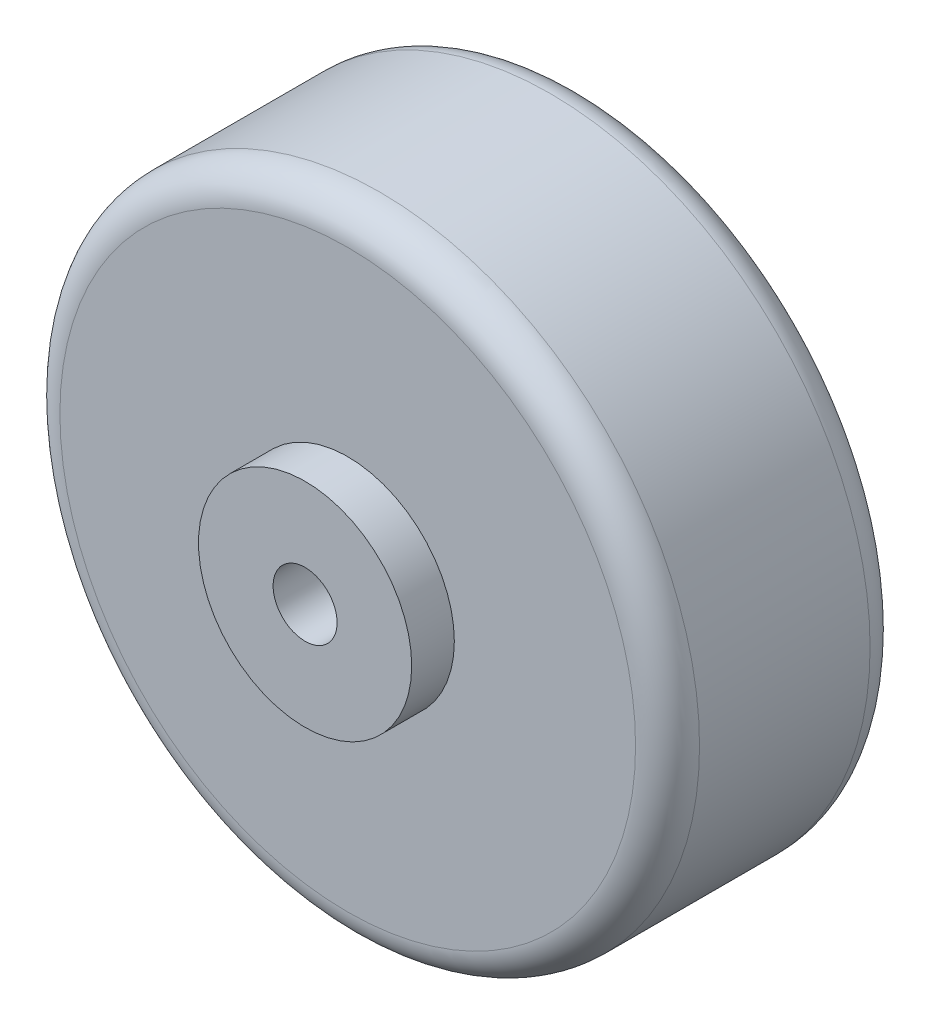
from build123d import *

# Parameters (mm, degrees)
ESQUISSE2_R             = 3
ENL_V_MAT_EXTRU_1_DEPTH = 52.961524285


with BuildPart() as part:
    # Esquisse1 → R_volution1 (revolve)
    with BuildSketch(Plane(origin=(0, 0, 0), x_dir=(1, 0, 0), z_dir=(0, 1, 0))):
        with BuildLine():
            Line((10, 15), (0, 15))
            Line((0, 15), (0, -15))
            Line((0, -15), (10, -15))
            Line((10, -15), (10, -11))
            Line((10, -11), (27, -11))
            ThreePointArc((27, -11), (29.121320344, -10.121320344), (30, -8))
            Line((30, -8), (30, 8))
            ThreePointArc((30, 8), (29.121320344, 10.121320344), (27, 11))
            Line((27, 11), (10, 11))
            Line((10, 11), (10, 15))
        make_face()
    revolve(axis=Axis((0, 0, -15), (0, 0, 1)))

    # Esquisse2 → Enl_v. mat.-Extru.1 (cut, through all)
    with BuildSketch(Plane.XY.offset(15)):
        Circle(ESQUISSE2_R)
    extrude(amount=-ENL_V_MAT_EXTRU_1_DEPTH, mode=Mode.SUBTRACT)


solid = part.part
